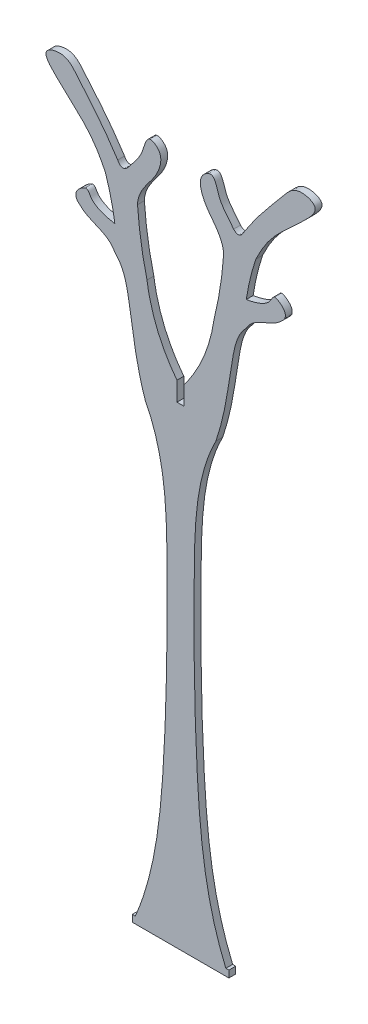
ISO-10303-21;
HEADER;
FILE_DESCRIPTION(('STEP AP214'),'2;1');
FILE_NAME('part.step','',(''),(''),'','','');
FILE_SCHEMA(('AUTOMOTIVE_DESIGN { 1 0 10303 214 1 1 1 1 }'));
ENDSEC;
DATA;
#1=APPLICATION_CONTEXT('core data for automotive mechanical design processes');
#2=APPLICATION_PROTOCOL_DEFINITION('international standard','automotive_design',2000,#1);
#3=PRODUCT_CONTEXT('',#1,'mechanical');
#4=PRODUCT('Part','Part','',(#3));
#5=PRODUCT_RELATED_PRODUCT_CATEGORY('part','',(#4));
#6=PRODUCT_DEFINITION_FORMATION('','',#4);
#7=PRODUCT_DEFINITION_CONTEXT('part definition',#1,'design');
#8=PRODUCT_DEFINITION('design','',#6,#7);
#9=PRODUCT_DEFINITION_SHAPE('','',#8);
#10=(LENGTH_UNIT() NAMED_UNIT(*) SI_UNIT(.MILLI.,.METRE.));
#11=(NAMED_UNIT(*) PLANE_ANGLE_UNIT() SI_UNIT($,.RADIAN.));
#12=(NAMED_UNIT(*) SI_UNIT($,.STERADIAN.) SOLID_ANGLE_UNIT());
#13=UNCERTAINTY_MEASURE_WITH_UNIT(LENGTH_MEASURE(1.E-05),#10,'distance_accuracy_value','');
#14=(GEOMETRIC_REPRESENTATION_CONTEXT(3) GLOBAL_UNCERTAINTY_ASSIGNED_CONTEXT((#13)) GLOBAL_UNIT_ASSIGNED_CONTEXT((#10,
#11,#12)) REPRESENTATION_CONTEXT('',''));
#15=CARTESIAN_POINT('',(0.,0.,0.));
#16=DIRECTION('',(0.,0.,1.));
#17=DIRECTION('',(1.,0.,0.));
#18=AXIS2_PLACEMENT_3D('',#15,#16,#17);
#19=CARTESIAN_POINT('',(-1511.29428119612,-519.438172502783,18.));
#20=DIRECTION('',(-2.81755677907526E-12,-1.,0.));
#21=DIRECTION('',(1.,-2.81755677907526E-12,0.));
#22=AXIS2_PLACEMENT_3D('',#19,#20,#21);
#23=PLANE('',#22);
#24=DIRECTION('',(-1.,2.81755677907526E-12,0.));
#25=VECTOR('',#24,1.);
#26=CARTESIAN_POINT('',(-1511.29428119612,-519.438172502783,0.));
#27=LINE('',#26,#25);
#28=CARTESIAN_POINT('',(-1503.29531998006,-519.438172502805,0.));
#29=VERTEX_POINT('',#28);
#30=CARTESIAN_POINT('',(-1511.29428119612,-519.438172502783,0.));
#31=VERTEX_POINT('',#30);
#32=EDGE_CURVE('E499',#29,#31,#27,.T.);
#33=ORIENTED_EDGE('',*,*,#32,.T.);
#34=DIRECTION('',(0.,0.,-1.));
#35=VECTOR('',#34,1.);
#36=CARTESIAN_POINT('',(-1511.29428119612,-519.438172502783,18.));
#37=LINE('',#36,#35);
#38=CARTESIAN_POINT('',(-1511.29428119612,-519.438172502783,18.));
#39=VERTEX_POINT('',#38);
#40=EDGE_CURVE('E11',#39,#31,#37,.T.);
#41=ORIENTED_EDGE('',*,*,#40,.F.);
#42=DIRECTION('',(-1.,2.81755677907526E-12,0.));
#43=VECTOR('',#42,1.);
#44=CARTESIAN_POINT('',(-1511.29428119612,-519.438172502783,18.));
#45=LINE('',#44,#43);
#46=CARTESIAN_POINT('',(-1503.29531998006,-519.438172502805,18.));
#47=VERTEX_POINT('',#46);
#48=EDGE_CURVE('E637',#47,#39,#45,.T.);
#49=ORIENTED_EDGE('',*,*,#48,.F.);
#50=DIRECTION('',(0.,0.,-1.));
#51=VECTOR('',#50,1.);
#52=CARTESIAN_POINT('',(-1503.29531998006,-519.438172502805,18.));
#53=LINE('',#52,#51);
#54=EDGE_CURVE('E244',#47,#29,#53,.T.);
#55=ORIENTED_EDGE('',*,*,#54,.T.);
#56=EDGE_LOOP('',(#33,#41,#49,#55));
#57=FACE_BOUND('',#56,.T.);
#58=ADVANCED_FACE('F32',(#57),#23,.F.);
#59=CARTESIAN_POINT('',(-1511.29428119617,-537.438172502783,18.));
#60=DIRECTION('',(1.,-2.81256499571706E-12,0.));
#61=DIRECTION('',(2.81256499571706E-12,1.,0.));
#62=AXIS2_PLACEMENT_3D('',#59,#60,#61);
#63=PLANE('',#62);
#64=DIRECTION('',(-2.81256499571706E-12,-1.,0.));
#65=VECTOR('',#64,1.);
#66=CARTESIAN_POINT('',(-1511.29428119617,-537.438172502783,0.));
#67=LINE('',#66,#65);
#68=CARTESIAN_POINT('',(-1511.29428119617,-537.438172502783,0.));
#69=VERTEX_POINT('',#68);
#70=EDGE_CURVE('E493',#31,#69,#67,.T.);
#71=ORIENTED_EDGE('',*,*,#70,.T.);
#72=DIRECTION('',(0.,0.,-1.));
#73=VECTOR('',#72,1.);
#74=CARTESIAN_POINT('',(-1511.29428119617,-537.438172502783,18.));
#75=LINE('',#74,#73);
#76=CARTESIAN_POINT('',(-1511.29428119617,-537.438172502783,18.));
#77=VERTEX_POINT('',#76);
#78=EDGE_CURVE('E40',#77,#69,#75,.T.);
#79=ORIENTED_EDGE('',*,*,#78,.F.);
#80=DIRECTION('',(-2.81256499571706E-12,-1.,0.));
#81=VECTOR('',#80,1.);
#82=CARTESIAN_POINT('',(-1511.29428119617,-537.438172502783,18.));
#83=LINE('',#82,#81);
#84=EDGE_CURVE('E151',#39,#77,#83,.T.);
#85=ORIENTED_EDGE('',*,*,#84,.F.);
#86=ORIENTED_EDGE('',*,*,#40,.T.);
#87=EDGE_LOOP('',(#71,#79,#85,#86));
#88=FACE_BOUND('',#87,.T.);
#89=ADVANCED_FACE('F683',(#88),#63,.F.);
#90=CARTESIAN_POINT('',(-1511.29428119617,-537.438172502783,18.));
#91=DIRECTION('',(2.81758703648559E-12,1.,0.));
#92=DIRECTION('',(-1.,2.81758703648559E-12,0.));
#93=AXIS2_PLACEMENT_3D('',#90,#91,#92);
#94=PLANE('',#93);
#95=DIRECTION('',(1.,-2.81758703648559E-12,0.));
#96=VECTOR('',#95,1.);
#97=CARTESIAN_POINT('',(-1511.29428119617,-537.438172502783,0.));
#98=LINE('',#97,#96);
#99=CARTESIAN_POINT('',(-1257.379244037,-537.438172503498,0.));
#100=VERTEX_POINT('',#99);
#101=EDGE_CURVE('E487',#69,#100,#98,.T.);
#102=ORIENTED_EDGE('',*,*,#101,.T.);
#103=DIRECTION('',(0.,0.,-1.));
#104=VECTOR('',#103,1.);
#105=CARTESIAN_POINT('',(-1257.379244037,-537.438172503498,18.));
#106=LINE('',#105,#104);
#107=CARTESIAN_POINT('',(-1257.379244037,-537.438172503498,18.));
#108=VERTEX_POINT('',#107);
#109=EDGE_CURVE('E479',#108,#100,#106,.T.);
#110=ORIENTED_EDGE('',*,*,#109,.F.);
#111=DIRECTION('',(1.,-2.81758703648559E-12,0.));
#112=VECTOR('',#111,1.);
#113=CARTESIAN_POINT('',(-1511.29428119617,-537.438172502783,18.));
#114=LINE('',#113,#112);
#115=EDGE_CURVE('E488',#77,#108,#114,.T.);
#116=ORIENTED_EDGE('',*,*,#115,.F.);
#117=ORIENTED_EDGE('',*,*,#78,.T.);
#118=EDGE_LOOP('',(#102,#110,#116,#117));
#119=FACE_BOUND('',#118,.T.);
#120=ADVANCED_FACE('F485',(#119),#94,.F.);
#121=CARTESIAN_POINT('',(-1257.37924403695,-519.438172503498,18.));
#122=DIRECTION('',(-1.,2.81256499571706E-12,0.));
#123=DIRECTION('',(-2.81256499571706E-12,-1.,0.));
#124=AXIS2_PLACEMENT_3D('',#121,#122,#123);
#125=PLANE('',#124);
#126=DIRECTION('',(2.81256499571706E-12,1.,0.));
#127=VECTOR('',#126,1.);
#128=CARTESIAN_POINT('',(-1257.37924403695,-519.438172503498,0.));
#129=LINE('',#128,#127);
#130=CARTESIAN_POINT('',(-1257.37924403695,-519.438172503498,0.));
#131=VERTEX_POINT('',#130);
#132=EDGE_CURVE('E495',#100,#131,#129,.T.);
#133=ORIENTED_EDGE('',*,*,#132,.T.);
#134=DIRECTION('',(0.,0.,-1.));
#135=VECTOR('',#134,1.);
#136=CARTESIAN_POINT('',(-1257.37924403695,-519.438172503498,18.));
#137=LINE('',#136,#135);
#138=CARTESIAN_POINT('',(-1257.37924403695,-519.438172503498,18.));
#139=VERTEX_POINT('',#138);
#140=EDGE_CURVE('E476',#139,#131,#137,.T.);
#141=ORIENTED_EDGE('',*,*,#140,.F.);
#142=DIRECTION('',(2.81256499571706E-12,1.,0.));
#143=VECTOR('',#142,1.);
#144=CARTESIAN_POINT('',(-1257.37924403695,-519.438172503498,18.));
#145=LINE('',#144,#143);
#146=EDGE_CURVE('E649',#108,#139,#145,.T.);
#147=ORIENTED_EDGE('',*,*,#146,.F.);
#148=ORIENTED_EDGE('',*,*,#109,.T.);
#149=EDGE_LOOP('',(#133,#141,#147,#148));
#150=FACE_BOUND('',#149,.T.);
#151=ADVANCED_FACE('F677',(#150),#125,.F.);
#152=CARTESIAN_POINT('',(-1265.37820525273,-519.438172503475,18.));
#153=DIRECTION('',(-2.81755677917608E-12,-1.,0.));
#154=DIRECTION('',(1.,-2.81755677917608E-12,0.));
#155=AXIS2_PLACEMENT_3D('',#152,#153,#154);
#156=PLANE('',#155);
#157=DIRECTION('',(-1.,2.81755677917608E-12,0.));
#158=VECTOR('',#157,1.);
#159=CARTESIAN_POINT('',(-1265.37820525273,-519.438172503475,0.));
#160=LINE('',#159,#158);
#161=CARTESIAN_POINT('',(-1265.37820525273,-519.438172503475,0.));
#162=VERTEX_POINT('',#161);
#163=EDGE_CURVE('E497',#131,#162,#160,.T.);
#164=ORIENTED_EDGE('',*,*,#163,.T.);
#165=DIRECTION('',(0.,0.,-1.));
#166=VECTOR('',#165,1.);
#167=CARTESIAN_POINT('',(-1265.37820525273,-519.438172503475,18.));
#168=LINE('',#167,#166);
#169=CARTESIAN_POINT('',(-1265.37820525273,-519.438172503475,18.));
#170=VERTEX_POINT('',#169);
#171=EDGE_CURVE('E473',#170,#162,#168,.T.);
#172=ORIENTED_EDGE('',*,*,#171,.F.);
#173=DIRECTION('',(-1.,2.81755677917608E-12,0.));
#174=VECTOR('',#173,1.);
#175=CARTESIAN_POINT('',(-1265.37820525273,-519.438172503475,18.));
#176=LINE('',#175,#174);
#177=EDGE_CURVE('E651',#139,#170,#176,.T.);
#178=ORIENTED_EDGE('',*,*,#177,.F.);
#179=ORIENTED_EDGE('',*,*,#140,.T.);
#180=EDGE_LOOP('',(#164,#172,#178,#179));
#181=FACE_BOUND('',#180,.T.);
#182=ADVANCED_FACE('F672',(#181),#156,.F.);
#183=CARTESIAN_POINT('',(-1265.37820525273,-519.438172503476,18.));
#184=CARTESIAN_POINT('',(-1287.45726612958,-467.720308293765,18.));
#185=CARTESIAN_POINT('',(-1323.80913077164,-340.019747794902,18.));
#186=CARTESIAN_POINT('',(-1347.89175846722,-55.1585898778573,18.));
#187=CARTESIAN_POINT('',(-1350.53965560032,285.79330852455,18.));
#188=CARTESIAN_POINT('',(-1345.81455719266,563.035618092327,18.));
#189=CARTESIAN_POINT('',(-1291.46742442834,667.917231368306,18.));
#190=B_SPLINE_CURVE_WITH_KNOTS('',3,(#183,#184,#185,#186,#187,#188,#189),.UNSPECIFIED.,.F.,.F.,
(4,1,1,1,4),(0.,0.136622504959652,0.325866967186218,0.696865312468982,0.984083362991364),.UNSPECIFIED.);
#191=DIRECTION('',(0.,0.,-1.));
#192=VECTOR('',#191,1.);
#193=SURFACE_OF_LINEAR_EXTRUSION('',#190,#192);
#194=CARTESIAN_POINT('',(-1265.37820525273,-519.438172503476,0.));
#195=CARTESIAN_POINT('',(-1287.45726612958,-467.720308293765,0.));
#196=CARTESIAN_POINT('',(-1323.80913077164,-340.019747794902,0.));
#197=CARTESIAN_POINT('',(-1347.89175846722,-55.1585898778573,0.));
#198=CARTESIAN_POINT('',(-1350.53965560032,285.79330852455,0.));
#199=CARTESIAN_POINT('',(-1345.81455719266,563.035618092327,0.));
#200=CARTESIAN_POINT('',(-1291.46742442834,667.917231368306,0.));
#201=B_SPLINE_CURVE_WITH_KNOTS('',3,(#194,#195,#196,#197,#198,#199,#200),.UNSPECIFIED.,.F.,.F.,
(4,1,1,1,4),(0.,0.136622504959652,0.325866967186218,0.696865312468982,0.984083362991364),.UNSPECIFIED.);
#202=CARTESIAN_POINT('',(-1291.46742442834,667.917231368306,0.));
#203=VERTEX_POINT('',#202);
#204=EDGE_CURVE('E503',#162,#203,#201,.T.);
#205=ORIENTED_EDGE('',*,*,#204,.T.);
#206=DIRECTION('',(0.,0.,-1.));
#207=VECTOR('',#206,1.);
#208=CARTESIAN_POINT('',(-1291.46742442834,667.917231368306,18.));
#209=LINE('',#208,#207);
#210=CARTESIAN_POINT('',(-1291.46742442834,667.917231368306,18.));
#211=VERTEX_POINT('',#210);
#212=EDGE_CURVE('E470',#211,#203,#209,.T.);
#213=ORIENTED_EDGE('',*,*,#212,.F.);
#214=EDGE_CURVE('E653',#170,#211,#190,.T.);
#215=ORIENTED_EDGE('',*,*,#214,.F.);
#216=ORIENTED_EDGE('',*,*,#171,.T.);
#217=EDGE_LOOP('',(#205,#213,#215,#216));
#218=FACE_BOUND('',#217,.T.);
#219=ADVANCED_FACE('F667',(#218),#193,.F.);
#220=CARTESIAN_POINT('',(-1291.46742442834,667.917231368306,18.));
#221=CARTESIAN_POINT('',(-1278.80325885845,705.017011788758,18.));
#222=CARTESIAN_POINT('',(-1262.09894114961,776.933907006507,18.));
#223=CARTESIAN_POINT('',(-1249.15473840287,879.299557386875,18.));
#224=CARTESIAN_POINT('',(-1234.26613656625,941.993846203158,18.));
#225=CARTESIAN_POINT('',(-1211.62006952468,964.822679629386,18.));
#226=B_SPLINE_CURVE_WITH_KNOTS('',3,(#220,#221,#222,#223,#224,#225),.UNSPECIFIED.,.F.,.F.,(4,1,
1,4),(0.,0.379260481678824,0.713287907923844,1.),.UNSPECIFIED.);
#227=DIRECTION('',(0.,0.,-1.));
#228=VECTOR('',#227,1.);
#229=SURFACE_OF_LINEAR_EXTRUSION('',#226,#228);
#230=CARTESIAN_POINT('',(-1291.46742442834,667.917231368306,0.));
#231=CARTESIAN_POINT('',(-1278.80325885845,705.017011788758,0.));
#232=CARTESIAN_POINT('',(-1262.09894114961,776.933907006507,0.));
#233=CARTESIAN_POINT('',(-1249.15473840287,879.299557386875,0.));
#234=CARTESIAN_POINT('',(-1234.26613656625,941.993846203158,0.));
#235=CARTESIAN_POINT('',(-1211.62006952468,964.822679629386,0.));
#236=B_SPLINE_CURVE_WITH_KNOTS('',3,(#230,#231,#232,#233,#234,#235),.UNSPECIFIED.,.F.,.F.,(4,1,
1,4),(0.,0.379260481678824,0.713287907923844,1.),.UNSPECIFIED.);
#237=CARTESIAN_POINT('',(-1211.62006952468,964.822679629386,0.));
#238=VERTEX_POINT('',#237);
#239=EDGE_CURVE('E507',#203,#238,#236,.T.);
#240=ORIENTED_EDGE('',*,*,#239,.T.);
#241=DIRECTION('',(0.,0.,-1.));
#242=VECTOR('',#241,1.);
#243=CARTESIAN_POINT('',(-1211.62006952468,964.822679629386,18.));
#244=LINE('',#243,#242);
#245=CARTESIAN_POINT('',(-1211.62006952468,964.822679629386,18.));
#246=VERTEX_POINT('',#245);
#247=EDGE_CURVE('E467',#246,#238,#244,.T.);
#248=ORIENTED_EDGE('',*,*,#247,.F.);
#249=EDGE_CURVE('E658',#211,#246,#226,.T.);
#250=ORIENTED_EDGE('',*,*,#249,.F.);
#251=ORIENTED_EDGE('',*,*,#212,.T.);
#252=EDGE_LOOP('',(#240,#248,#250,#251));
#253=FACE_BOUND('',#252,.T.);
#254=ADVANCED_FACE('F671',(#253),#229,.F.);
#255=CARTESIAN_POINT('',(-1211.62006952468,964.822679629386,18.));
#256=CARTESIAN_POINT('',(-1192.36168237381,1001.62275757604,18.));
#257=CARTESIAN_POINT('',(-1145.79768086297,999.806058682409,18.));
#258=CARTESIAN_POINT('',(-1118.99050541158,1027.71811654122,18.));
#259=B_SPLINE_CURVE_WITH_KNOTS('',3,(#255,#256,#257,#258),.UNSPECIFIED.,.F.,.F.,(4,4),(0.,1.),.UNSPECIFIED.);
#260=DIRECTION('',(0.,0.,-1.));
#261=VECTOR('',#260,1.);
#262=SURFACE_OF_LINEAR_EXTRUSION('',#259,#261);
#263=CARTESIAN_POINT('',(-1211.62006952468,964.822679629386,0.));
#264=CARTESIAN_POINT('',(-1192.36168237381,1001.62275757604,0.));
#265=CARTESIAN_POINT('',(-1145.79768086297,999.806058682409,0.));
#266=CARTESIAN_POINT('',(-1118.99050541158,1027.71811654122,0.));
#267=B_SPLINE_CURVE_WITH_KNOTS('',3,(#263,#264,#265,#266),.UNSPECIFIED.,.F.,.F.,(4,4),(0.,1.),.UNSPECIFIED.);
#268=CARTESIAN_POINT('',(-1118.99050541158,1027.71811654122,0.));
#269=VERTEX_POINT('',#268);
#270=EDGE_CURVE('E514',#238,#269,#267,.T.);
#271=ORIENTED_EDGE('',*,*,#270,.T.);
#272=DIRECTION('',(0.,0.,-1.));
#273=VECTOR('',#272,1.);
#274=CARTESIAN_POINT('',(-1118.99050541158,1027.71811654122,18.));
#275=LINE('',#274,#273);
#276=CARTESIAN_POINT('',(-1118.99050541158,1027.71811654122,18.));
#277=VERTEX_POINT('',#276);
#278=EDGE_CURVE('E464',#277,#269,#275,.T.);
#279=ORIENTED_EDGE('',*,*,#278,.F.);
#280=EDGE_CURVE('E944',#246,#277,#259,.T.);
#281=ORIENTED_EDGE('',*,*,#280,.F.);
#282=ORIENTED_EDGE('',*,*,#247,.T.);
#283=EDGE_LOOP('',(#271,#279,#281,#282));
#284=FACE_BOUND('',#283,.T.);
#285=ADVANCED_FACE('F727',(#284),#262,.F.);
#286=CARTESIAN_POINT('',(-1118.99050541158,1027.71811654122,18.));
#287=CARTESIAN_POINT('',(-1099.96715776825,1041.83106666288,18.));
#288=CARTESIAN_POINT('',(-1112.81295666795,1063.21847998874,18.));
#289=CARTESIAN_POINT('',(-1140.15232798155,1076.14677775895,18.));
#290=CARTESIAN_POINT('',(-1147.61665996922,1057.69885967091,18.));
#291=CARTESIAN_POINT('',(-1169.16528346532,1039.08750545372,18.));
#292=CARTESIAN_POINT('',(-1194.51965241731,1033.08454684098,18.));
#293=CARTESIAN_POINT('',(-1211.62006952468,1030.15246045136,18.));
#294=B_SPLINE_CURVE_WITH_KNOTS('',3,(#286,#287,#288,#289,#290,#291,#292,#293),.UNSPECIFIED.,.F.,
.F.,(4,1,1,1,1,4),(0.,0.336795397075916,0.409108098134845,0.521188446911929,0.643455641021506,
1.),.UNSPECIFIED.);
#295=DIRECTION('',(0.,0.,-1.));
#296=VECTOR('',#295,1.);
#297=SURFACE_OF_LINEAR_EXTRUSION('',#294,#296);
#298=CARTESIAN_POINT('',(-1118.99050541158,1027.71811654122,0.));
#299=CARTESIAN_POINT('',(-1099.96715776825,1041.83106666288,0.));
#300=CARTESIAN_POINT('',(-1112.81295666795,1063.21847998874,0.));
#301=CARTESIAN_POINT('',(-1140.15232798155,1076.14677775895,0.));
#302=CARTESIAN_POINT('',(-1147.61665996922,1057.69885967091,0.));
#303=CARTESIAN_POINT('',(-1169.16528346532,1039.08750545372,0.));
#304=CARTESIAN_POINT('',(-1194.51965241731,1033.08454684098,0.));
#305=CARTESIAN_POINT('',(-1211.62006952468,1030.15246045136,0.));
#306=B_SPLINE_CURVE_WITH_KNOTS('',3,(#298,#299,#300,#301,#302,#303,#304,#305),.UNSPECIFIED.,.F.,
.F.,(4,1,1,1,1,4),(0.,0.336795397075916,0.409108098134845,0.521188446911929,0.643455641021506,
1.),.UNSPECIFIED.);
#307=CARTESIAN_POINT('',(-1211.62006952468,1030.15246045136,0.));
#308=VERTEX_POINT('',#307);
#309=EDGE_CURVE('E521',#269,#308,#306,.T.);
#310=ORIENTED_EDGE('',*,*,#309,.T.);
#311=DIRECTION('',(0.,0.,-1.));
#312=VECTOR('',#311,1.);
#313=CARTESIAN_POINT('',(-1211.62006952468,1030.15246045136,18.));
#314=LINE('',#313,#312);
#315=CARTESIAN_POINT('',(-1211.62006952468,1030.15246045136,18.));
#316=VERTEX_POINT('',#315);
#317=EDGE_CURVE('E461',#316,#308,#314,.T.);
#318=ORIENTED_EDGE('',*,*,#317,.F.);
#319=EDGE_CURVE('E937',#277,#316,#294,.T.);
#320=ORIENTED_EDGE('',*,*,#319,.F.);
#321=ORIENTED_EDGE('',*,*,#278,.T.);
#322=EDGE_LOOP('',(#310,#318,#320,#321));
#323=FACE_BOUND('',#322,.T.);
#324=ADVANCED_FACE('F736',(#323),#297,.F.);
#325=CARTESIAN_POINT('',(-1211.62006952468,1030.15246045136,18.));
#326=CARTESIAN_POINT('',(-1203.78454107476,1083.42010421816,18.));
#327=CARTESIAN_POINT('',(-1186.60667726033,1134.53220551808,18.));
#328=B_SPLINE_CURVE_WITH_KNOTS('',2,(#325,#326,#327),.UNSPECIFIED.,.F.,.F.,(3,3),(0.,1.),.UNSPECIFIED.);
#329=DIRECTION('',(0.,0.,-1.));
#330=VECTOR('',#329,1.);
#331=SURFACE_OF_LINEAR_EXTRUSION('',#328,#330);
#332=CARTESIAN_POINT('',(-1211.62006952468,1030.15246045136,0.));
#333=CARTESIAN_POINT('',(-1203.78454107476,1083.42010421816,0.));
#334=CARTESIAN_POINT('',(-1186.60667726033,1134.53220551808,0.));
#335=B_SPLINE_CURVE_WITH_KNOTS('',2,(#332,#333,#334),.UNSPECIFIED.,.F.,.F.,(3,3),(0.,1.),.UNSPECIFIED.);
#336=CARTESIAN_POINT('',(-1186.60667726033,1134.53220551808,0.));
#337=VERTEX_POINT('',#336);
#338=EDGE_CURVE('E528',#308,#337,#335,.T.);
#339=ORIENTED_EDGE('',*,*,#338,.T.);
#340=DIRECTION('',(0.,0.,-1.));
#341=VECTOR('',#340,1.);
#342=CARTESIAN_POINT('',(-1186.60667726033,1134.53220551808,18.));
#343=LINE('',#342,#341);
#344=CARTESIAN_POINT('',(-1186.60667726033,1134.53220551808,18.));
#345=VERTEX_POINT('',#344);
#346=EDGE_CURVE('E458',#345,#337,#343,.T.);
#347=ORIENTED_EDGE('',*,*,#346,.F.);
#348=EDGE_CURVE('E929',#316,#345,#328,.T.);
#349=ORIENTED_EDGE('',*,*,#348,.F.);
#350=ORIENTED_EDGE('',*,*,#317,.T.);
#351=EDGE_LOOP('',(#339,#347,#349,#350));
#352=FACE_BOUND('',#351,.T.);
#353=ADVANCED_FACE('F745',(#352),#331,.F.);
#354=CARTESIAN_POINT('',(-1186.60667726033,1134.53220551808,18.));
#355=CARTESIAN_POINT('',(-1149.40099892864,1212.77116237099,18.));
#356=CARTESIAN_POINT('',(-1108.9398174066,1234.04744478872,18.));
#357=CARTESIAN_POINT('',(-1011.35737013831,1334.96569604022,18.));
#358=CARTESIAN_POINT('',(-1071.34135448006,1351.98572511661,18.));
#359=CARTESIAN_POINT('',(-1098.80744979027,1334.51720225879,18.));
#360=CARTESIAN_POINT('',(-1122.95795190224,1303.50484063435,18.));
#361=CARTESIAN_POINT('',(-1166.23987155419,1255.0222631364,18.));
#362=CARTESIAN_POINT('',(-1199.75169342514,1208.57672281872,18.));
#363=CARTESIAN_POINT('',(-1218.99104068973,1178.92762916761,18.));
#364=B_SPLINE_CURVE_WITH_KNOTS('',3,(#354,#355,#356,#357,#358,#359,#360,#361,#362,#363),
.UNSPECIFIED.,.F.,.F.,(4,1,1,1,1,1,1,4),(0.,0.385763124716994,0.485334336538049,
0.571206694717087,0.624037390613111,0.671733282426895,0.795732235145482,1.),.UNSPECIFIED.);
#365=DIRECTION('',(0.,0.,-1.));
#366=VECTOR('',#365,1.);
#367=SURFACE_OF_LINEAR_EXTRUSION('',#364,#366);
#368=CARTESIAN_POINT('',(-1186.60667726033,1134.53220551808,0.));
#369=CARTESIAN_POINT('',(-1149.40099892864,1212.77116237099,0.));
#370=CARTESIAN_POINT('',(-1108.9398174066,1234.04744478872,0.));
#371=CARTESIAN_POINT('',(-1011.35737013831,1334.96569604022,0.));
#372=CARTESIAN_POINT('',(-1071.34135448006,1351.98572511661,0.));
#373=CARTESIAN_POINT('',(-1098.80744979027,1334.51720225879,0.));
#374=CARTESIAN_POINT('',(-1122.95795190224,1303.50484063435,0.));
#375=CARTESIAN_POINT('',(-1166.23987155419,1255.0222631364,0.));
#376=CARTESIAN_POINT('',(-1199.75169342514,1208.57672281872,0.));
#377=CARTESIAN_POINT('',(-1218.99104068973,1178.92762916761,0.));
#378=B_SPLINE_CURVE_WITH_KNOTS('',3,(#368,#369,#370,#371,#372,#373,#374,#375,#376,#377),
.UNSPECIFIED.,.F.,.F.,(4,1,1,1,1,1,1,4),(0.,0.385763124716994,0.485334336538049,
0.571206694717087,0.624037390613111,0.671733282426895,0.795732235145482,1.),.UNSPECIFIED.);
#379=CARTESIAN_POINT('',(-1218.99104068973,1178.92762916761,0.));
#380=VERTEX_POINT('',#379);
#381=EDGE_CURVE('E535',#337,#380,#378,.T.);
#382=ORIENTED_EDGE('',*,*,#381,.T.);
#383=DIRECTION('',(0.,0.,-1.));
#384=VECTOR('',#383,1.);
#385=CARTESIAN_POINT('',(-1218.99104068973,1178.92762916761,18.));
#386=LINE('',#385,#384);
#387=CARTESIAN_POINT('',(-1218.99104068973,1178.92762916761,18.));
#388=VERTEX_POINT('',#387);
#389=EDGE_CURVE('E455',#388,#380,#386,.T.);
#390=ORIENTED_EDGE('',*,*,#389,.F.);
#391=EDGE_CURVE('E913',#345,#388,#364,.T.);
#392=ORIENTED_EDGE('',*,*,#391,.F.);
#393=ORIENTED_EDGE('',*,*,#346,.T.);
#394=EDGE_LOOP('',(#382,#390,#392,#393));
#395=FACE_BOUND('',#394,.T.);
#396=ADVANCED_FACE('F755',(#395),#367,.F.);
#397=CARTESIAN_POINT('',(-1218.99104068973,1178.92762916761,18.));
#398=CARTESIAN_POINT('',(-1229.80070851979,1158.86484057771,18.));
#399=CARTESIAN_POINT('',(-1244.79601062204,1173.85451622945,18.));
#400=B_SPLINE_CURVE_WITH_KNOTS('',2,(#397,#398,#399),.UNSPECIFIED.,.F.,.F.,(3,3),(0.,1.),.UNSPECIFIED.);
#401=DIRECTION('',(0.,0.,-1.));
#402=VECTOR('',#401,1.);
#403=SURFACE_OF_LINEAR_EXTRUSION('',#400,#402);
#404=CARTESIAN_POINT('',(-1218.99104068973,1178.92762916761,0.));
#405=CARTESIAN_POINT('',(-1229.80070851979,1158.86484057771,0.));
#406=CARTESIAN_POINT('',(-1244.79601062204,1173.85451622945,0.));
#407=B_SPLINE_CURVE_WITH_KNOTS('',2,(#404,#405,#406),.UNSPECIFIED.,.F.,.F.,(3,3),(0.,1.),.UNSPECIFIED.);
#408=CARTESIAN_POINT('',(-1244.79601062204,1173.85451622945,0.));
#409=VERTEX_POINT('',#408);
#410=EDGE_CURVE('E542',#380,#409,#407,.T.);
#411=ORIENTED_EDGE('',*,*,#410,.T.);
#412=DIRECTION('',(0.,0.,-1.));
#413=VECTOR('',#412,1.);
#414=CARTESIAN_POINT('',(-1244.79601062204,1173.85451622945,18.));
#415=LINE('',#414,#413);
#416=CARTESIAN_POINT('',(-1244.79601062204,1173.85451622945,18.));
#417=VERTEX_POINT('',#416);
#418=EDGE_CURVE('E452',#417,#409,#415,.T.);
#419=ORIENTED_EDGE('',*,*,#418,.F.);
#420=EDGE_CURVE('E912',#388,#417,#400,.T.);
#421=ORIENTED_EDGE('',*,*,#420,.F.);
#422=ORIENTED_EDGE('',*,*,#389,.T.);
#423=EDGE_LOOP('',(#411,#419,#421,#422));
#424=FACE_BOUND('',#423,.T.);
#425=ADVANCED_FACE('F765',(#424),#403,.F.);
#426=CARTESIAN_POINT('',(-1244.79601062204,1173.85451622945,18.));
#427=CARTESIAN_POINT('',(-1266.47505156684,1201.80617067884,18.));
#428=CARTESIAN_POINT('',(-1282.12972548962,1215.3674814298,18.));
#429=CARTESIAN_POINT('',(-1297.16624888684,1279.03474735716,18.));
#430=CARTESIAN_POINT('',(-1332.42652300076,1255.59841326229,18.));
#431=CARTESIAN_POINT('',(-1333.18015892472,1231.59021205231,18.));
#432=CARTESIAN_POINT('',(-1327.75313894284,1211.0213928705,18.));
#433=CARTESIAN_POINT('',(-1315.13896823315,1184.61300915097,18.));
#434=CARTESIAN_POINT('',(-1286.99086647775,1153.21107970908,18.));
#435=CARTESIAN_POINT('',(-1271.57130340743,1121.36323703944,18.));
#436=CARTESIAN_POINT('',(-1271.13665378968,1103.18448602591,18.));
#437=B_SPLINE_CURVE_WITH_KNOTS('',3,(#426,#427,#428,#429,#430,#431,#432,#433,#434,#435,#436),
.UNSPECIFIED.,.F.,.F.,(4,1,1,1,1,1,1,1,4),(0.,0.252302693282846,0.363690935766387,
0.456026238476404,0.541932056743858,0.588618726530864,0.664111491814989,0.825410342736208,1.),.UNSPECIFIED.);
#438=DIRECTION('',(0.,0.,-1.));
#439=VECTOR('',#438,1.);
#440=SURFACE_OF_LINEAR_EXTRUSION('',#437,#439);
#441=CARTESIAN_POINT('',(-1244.79601062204,1173.85451622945,0.));
#442=CARTESIAN_POINT('',(-1266.47505156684,1201.80617067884,0.));
#443=CARTESIAN_POINT('',(-1282.12972548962,1215.3674814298,0.));
#444=CARTESIAN_POINT('',(-1297.16624888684,1279.03474735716,0.));
#445=CARTESIAN_POINT('',(-1332.42652300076,1255.59841326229,0.));
#446=CARTESIAN_POINT('',(-1333.18015892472,1231.59021205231,0.));
#447=CARTESIAN_POINT('',(-1327.75313894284,1211.0213928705,0.));
#448=CARTESIAN_POINT('',(-1315.13896823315,1184.61300915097,0.));
#449=CARTESIAN_POINT('',(-1286.99086647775,1153.21107970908,0.));
#450=CARTESIAN_POINT('',(-1271.57130340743,1121.36323703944,0.));
#451=CARTESIAN_POINT('',(-1271.13665378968,1103.18448602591,0.));
#452=B_SPLINE_CURVE_WITH_KNOTS('',3,(#441,#442,#443,#444,#445,#446,#447,#448,#449,#450,#451),
.UNSPECIFIED.,.F.,.F.,(4,1,1,1,1,1,1,1,4),(0.,0.252302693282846,0.363690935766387,
0.456026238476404,0.541932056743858,0.588618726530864,0.664111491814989,0.825410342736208,1.),.UNSPECIFIED.);
#453=CARTESIAN_POINT('',(-1271.13665378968,1103.18448602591,0.));
#454=VERTEX_POINT('',#453);
#455=EDGE_CURVE('E549',#409,#454,#452,.T.);
#456=ORIENTED_EDGE('',*,*,#455,.T.);
#457=DIRECTION('',(0.,0.,-1.));
#458=VECTOR('',#457,1.);
#459=CARTESIAN_POINT('',(-1271.13665378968,1103.18448602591,18.));
#460=LINE('',#459,#458);
#461=CARTESIAN_POINT('',(-1271.13665378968,1103.18448602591,18.));
#462=VERTEX_POINT('',#461);
#463=EDGE_CURVE('E449',#462,#454,#460,.T.);
#464=ORIENTED_EDGE('',*,*,#463,.F.);
#465=EDGE_CURVE('E911',#417,#462,#437,.T.);
#466=ORIENTED_EDGE('',*,*,#465,.F.);
#467=ORIENTED_EDGE('',*,*,#418,.T.);
#468=EDGE_LOOP('',(#456,#464,#466,#467));
#469=FACE_BOUND('',#468,.T.);
#470=ADVANCED_FACE('F775',(#469),#440,.F.);
#471=CARTESIAN_POINT('',(-1271.13665378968,1103.18448602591,18.));
#472=CARTESIAN_POINT('',(-1276.6831977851,1022.67722106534,18.));
#473=CARTESIAN_POINT('',(-1296.05420812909,944.152143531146,18.));
#474=B_SPLINE_CURVE_WITH_KNOTS('',2,(#471,#472,#473),.UNSPECIFIED.,.F.,.F.,(3,3),(0.,1.),.UNSPECIFIED.);
#475=DIRECTION('',(0.,0.,-1.));
#476=VECTOR('',#475,1.);
#477=SURFACE_OF_LINEAR_EXTRUSION('',#474,#476);
#478=CARTESIAN_POINT('',(-1271.13665378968,1103.18448602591,0.));
#479=CARTESIAN_POINT('',(-1276.6831977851,1022.67722106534,0.));
#480=CARTESIAN_POINT('',(-1296.05420812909,944.152143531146,0.));
#481=B_SPLINE_CURVE_WITH_KNOTS('',2,(#478,#479,#480),.UNSPECIFIED.,.F.,.F.,(3,3),(0.,1.),.UNSPECIFIED.);
#482=CARTESIAN_POINT('',(-1296.05420812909,944.152143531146,0.));
#483=VERTEX_POINT('',#482);
#484=EDGE_CURVE('E556',#454,#483,#481,.T.);
#485=ORIENTED_EDGE('',*,*,#484,.T.);
#486=DIRECTION('',(0.,0.,-1.));
#487=VECTOR('',#486,1.);
#488=CARTESIAN_POINT('',(-1296.05420812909,944.152143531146,18.));
#489=LINE('',#488,#487);
#490=CARTESIAN_POINT('',(-1296.05420812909,944.152143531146,18.));
#491=VERTEX_POINT('',#490);
#492=EDGE_CURVE('E446',#491,#483,#489,.T.);
#493=ORIENTED_EDGE('',*,*,#492,.F.);
#494=EDGE_CURVE('E372',#462,#491,#474,.T.);
#495=ORIENTED_EDGE('',*,*,#494,.F.);
#496=ORIENTED_EDGE('',*,*,#463,.T.);
#497=EDGE_LOOP('',(#485,#493,#495,#496));
#498=FACE_BOUND('',#497,.T.);
#499=ADVANCED_FACE('F362',(#498),#477,.F.);
#500=CARTESIAN_POINT('',(-1296.05420812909,944.152143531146,18.));
#501=CARTESIAN_POINT('',(-1311.59146717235,837.753798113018,18.));
#502=CARTESIAN_POINT('',(-1374.83676261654,755.407069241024,18.));
#503=B_SPLINE_CURVE_WITH_KNOTS('',2,(#500,#501,#502),.UNSPECIFIED.,.F.,.F.,(3,3),(0.,1.),.UNSPECIFIED.);
#504=DIRECTION('',(0.,0.,-1.));
#505=VECTOR('',#504,1.);
#506=SURFACE_OF_LINEAR_EXTRUSION('',#503,#505);
#507=CARTESIAN_POINT('',(-1296.05420812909,944.152143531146,0.));
#508=CARTESIAN_POINT('',(-1311.59146717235,837.753798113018,0.));
#509=CARTESIAN_POINT('',(-1374.83676261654,755.407069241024,0.));
#510=B_SPLINE_CURVE_WITH_KNOTS('',2,(#507,#508,#509),.UNSPECIFIED.,.F.,.F.,(3,3),(0.,1.),.UNSPECIFIED.);
#511=CARTESIAN_POINT('',(-1374.83676261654,755.407069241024,0.));
#512=VERTEX_POINT('',#511);
#513=EDGE_CURVE('E563',#483,#512,#510,.T.);
#514=ORIENTED_EDGE('',*,*,#513,.T.);
#515=DIRECTION('',(0.,0.,-1.));
#516=VECTOR('',#515,1.);
#517=CARTESIAN_POINT('',(-1374.83676261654,755.407069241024,18.));
#518=LINE('',#517,#516);
#519=CARTESIAN_POINT('',(-1374.83676261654,755.407069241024,18.));
#520=VERTEX_POINT('',#519);
#521=EDGE_CURVE('E443',#520,#512,#518,.T.);
#522=ORIENTED_EDGE('',*,*,#521,.F.);
#523=EDGE_CURVE('E366',#491,#520,#503,.T.);
#524=ORIENTED_EDGE('',*,*,#523,.F.);
#525=ORIENTED_EDGE('',*,*,#492,.T.);
#526=EDGE_LOOP('',(#514,#522,#524,#525));
#527=FACE_BOUND('',#526,.T.);
#528=ADVANCED_FACE('F357',(#527),#506,.F.);
#529=CARTESIAN_POINT('',(-1374.83676261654,755.407069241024,18.));
#530=DIRECTION('',(1.,0.,0.));
#531=DIRECTION('',(0.,0.,-1.));
#532=AXIS2_PLACEMENT_3D('',#529,#530,#531);
#533=PLANE('',#532);
#534=DIRECTION('',(0.,-1.,0.));
#535=VECTOR('',#534,1.);
#536=CARTESIAN_POINT('',(-1374.83676261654,755.407069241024,0.));
#537=LINE('',#536,#535);
#538=CARTESIAN_POINT('',(-1374.83676261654,705.407069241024,0.));
#539=VERTEX_POINT('',#538);
#540=EDGE_CURVE('E570',#512,#539,#537,.T.);
#541=ORIENTED_EDGE('',*,*,#540,.T.);
#542=DIRECTION('',(0.,0.,-1.));
#543=VECTOR('',#542,1.);
#544=CARTESIAN_POINT('',(-1374.83676261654,705.407069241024,18.));
#545=LINE('',#544,#543);
#546=CARTESIAN_POINT('',(-1374.83676261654,705.407069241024,18.));
#547=VERTEX_POINT('',#546);
#548=EDGE_CURVE('E440',#547,#539,#545,.T.);
#549=ORIENTED_EDGE('',*,*,#548,.F.);
#550=DIRECTION('',(0.,-1.,0.));
#551=VECTOR('',#550,1.);
#552=CARTESIAN_POINT('',(-1374.83676261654,755.407069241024,18.));
#553=LINE('',#552,#551);
#554=EDGE_CURVE('E371',#520,#547,#553,.T.);
#555=ORIENTED_EDGE('',*,*,#554,.F.);
#556=ORIENTED_EDGE('',*,*,#521,.T.);
#557=EDGE_LOOP('',(#541,#549,#555,#556));
#558=FACE_BOUND('',#557,.T.);
#559=ADVANCED_FACE('F353',(#558),#533,.F.);
#560=CARTESIAN_POINT('',(-1393.83676261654,705.407069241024,18.));
#561=DIRECTION('',(0.,-1.,0.));
#562=DIRECTION('',(0.,0.,-1.));
#563=AXIS2_PLACEMENT_3D('',#560,#561,#562);
#564=PLANE('',#563);
#565=DIRECTION('',(-1.,0.,0.));
#566=VECTOR('',#565,1.);
#567=CARTESIAN_POINT('',(-1393.83676261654,705.407069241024,0.));
#568=LINE('',#567,#566);
#569=CARTESIAN_POINT('',(-1393.83676261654,705.407069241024,0.));
#570=VERTEX_POINT('',#569);
#571=EDGE_CURVE('E575',#539,#570,#568,.T.);
#572=ORIENTED_EDGE('',*,*,#571,.T.);
#573=DIRECTION('',(0.,0.,-1.));
#574=VECTOR('',#573,1.);
#575=CARTESIAN_POINT('',(-1393.83676261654,705.407069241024,18.));
#576=LINE('',#575,#574);
#577=CARTESIAN_POINT('',(-1393.83676261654,705.407069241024,18.));
#578=VERTEX_POINT('',#577);
#579=EDGE_CURVE('E393',#578,#570,#576,.T.);
#580=ORIENTED_EDGE('',*,*,#579,.F.);
#581=DIRECTION('',(-1.,0.,0.));
#582=VECTOR('',#581,1.);
#583=CARTESIAN_POINT('',(-1393.83676261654,705.407069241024,18.));
#584=LINE('',#583,#582);
#585=EDGE_CURVE('E380',#547,#578,#584,.T.);
#586=ORIENTED_EDGE('',*,*,#585,.F.);
#587=ORIENTED_EDGE('',*,*,#548,.T.);
#588=EDGE_LOOP('',(#572,#580,#586,#587));
#589=FACE_BOUND('',#588,.T.);
#590=ADVANCED_FACE('F349',(#589),#564,.F.);
#591=CARTESIAN_POINT('',(-1393.83676261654,755.407069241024,18.));
#592=DIRECTION('',(-1.,0.,0.));
#593=DIRECTION('',(0.,0.,1.));
#594=AXIS2_PLACEMENT_3D('',#591,#592,#593);
#595=PLANE('',#594);
#596=DIRECTION('',(0.,1.,0.));
#597=VECTOR('',#596,1.);
#598=CARTESIAN_POINT('',(-1393.83676261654,755.407069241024,0.));
#599=LINE('',#598,#597);
#600=CARTESIAN_POINT('',(-1393.83676261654,755.407069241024,0.));
#601=VERTEX_POINT('',#600);
#602=EDGE_CURVE('E391',#570,#601,#599,.T.);
#603=ORIENTED_EDGE('',*,*,#602,.T.);
#604=DIRECTION('',(0.,0.,-1.));
#605=VECTOR('',#604,1.);
#606=CARTESIAN_POINT('',(-1393.83676261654,755.407069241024,18.));
#607=LINE('',#606,#605);
#608=CARTESIAN_POINT('',(-1393.83676261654,755.407069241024,18.));
#609=VERTEX_POINT('',#608);
#610=EDGE_CURVE('E389',#609,#601,#607,.T.);
#611=ORIENTED_EDGE('',*,*,#610,.F.);
#612=DIRECTION('',(0.,1.,0.));
#613=VECTOR('',#612,1.);
#614=CARTESIAN_POINT('',(-1393.83676261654,755.407069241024,18.));
#615=LINE('',#614,#613);
#616=EDGE_CURVE('E337',#578,#609,#615,.T.);
#617=ORIENTED_EDGE('',*,*,#616,.F.);
#618=ORIENTED_EDGE('',*,*,#579,.T.);
#619=EDGE_LOOP('',(#603,#611,#617,#618));
#620=FACE_BOUND('',#619,.T.);
#621=ADVANCED_FACE('F345',(#620),#595,.F.);
#622=CARTESIAN_POINT('',(-1393.83676261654,755.407069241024,18.));
#623=CARTESIAN_POINT('',(-1457.08205806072,837.753798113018,18.));
#624=CARTESIAN_POINT('',(-1472.61931710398,944.152143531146,18.));
#625=B_SPLINE_CURVE_WITH_KNOTS('',2,(#622,#623,#624),.UNSPECIFIED.,.F.,.F.,(3,3),(0.,1.),.UNSPECIFIED.);
#626=DIRECTION('',(0.,0.,-1.));
#627=VECTOR('',#626,1.);
#628=SURFACE_OF_LINEAR_EXTRUSION('',#625,#627);
#629=CARTESIAN_POINT('',(-1393.83676261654,755.407069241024,0.));
#630=CARTESIAN_POINT('',(-1457.08205806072,837.753798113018,0.));
#631=CARTESIAN_POINT('',(-1472.61931710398,944.152143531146,0.));
#632=B_SPLINE_CURVE_WITH_KNOTS('',2,(#629,#630,#631),.UNSPECIFIED.,.F.,.F.,(3,3),(0.,1.),.UNSPECIFIED.);
#633=CARTESIAN_POINT('',(-1472.61931710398,944.152143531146,0.));
#634=VERTEX_POINT('',#633);
#635=EDGE_CURVE('E398',#601,#634,#632,.T.);
#636=ORIENTED_EDGE('',*,*,#635,.T.);
#637=DIRECTION('',(0.,0.,-1.));
#638=VECTOR('',#637,1.);
#639=CARTESIAN_POINT('',(-1472.61931710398,944.152143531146,18.));
#640=LINE('',#639,#638);
#641=CARTESIAN_POINT('',(-1472.61931710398,944.152143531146,18.));
#642=VERTEX_POINT('',#641);
#643=EDGE_CURVE('E394',#642,#634,#640,.T.);
#644=ORIENTED_EDGE('',*,*,#643,.F.);
#645=EDGE_CURVE('E329',#609,#642,#625,.T.);
#646=ORIENTED_EDGE('',*,*,#645,.F.);
#647=ORIENTED_EDGE('',*,*,#610,.T.);
#648=EDGE_LOOP('',(#636,#644,#646,#647));
#649=FACE_BOUND('',#648,.T.);
#650=ADVANCED_FACE('F342',(#649),#628,.F.);
#651=CARTESIAN_POINT('',(-1472.61931710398,944.152143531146,18.));
#652=CARTESIAN_POINT('',(-1491.99032744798,1022.67722106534,18.));
#653=CARTESIAN_POINT('',(-1497.53687144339,1103.18448602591,18.));
#654=B_SPLINE_CURVE_WITH_KNOTS('',2,(#651,#652,#653),.UNSPECIFIED.,.F.,.F.,(3,3),(0.,1.),.UNSPECIFIED.);
#655=DIRECTION('',(0.,0.,-1.));
#656=VECTOR('',#655,1.);
#657=SURFACE_OF_LINEAR_EXTRUSION('',#654,#656);
#658=CARTESIAN_POINT('',(-1472.61931710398,944.152143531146,0.));
#659=CARTESIAN_POINT('',(-1491.99032744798,1022.67722106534,0.));
#660=CARTESIAN_POINT('',(-1497.53687144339,1103.18448602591,0.));
#661=B_SPLINE_CURVE_WITH_KNOTS('',2,(#658,#659,#660),.UNSPECIFIED.,.F.,.F.,(3,3),(0.,1.),.UNSPECIFIED.);
#662=CARTESIAN_POINT('',(-1497.53687144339,1103.18448602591,0.));
#663=VERTEX_POINT('',#662);
#664=EDGE_CURVE('E581',#634,#663,#661,.T.);
#665=ORIENTED_EDGE('',*,*,#664,.T.);
#666=DIRECTION('',(0.,0.,-1.));
#667=VECTOR('',#666,1.);
#668=CARTESIAN_POINT('',(-1497.53687144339,1103.18448602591,18.));
#669=LINE('',#668,#667);
#670=CARTESIAN_POINT('',(-1497.53687144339,1103.18448602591,18.));
#671=VERTEX_POINT('',#670);
#672=EDGE_CURVE('E401',#671,#663,#669,.T.);
#673=ORIENTED_EDGE('',*,*,#672,.F.);
#674=EDGE_CURVE('E321',#642,#671,#654,.T.);
#675=ORIENTED_EDGE('',*,*,#674,.F.);
#676=ORIENTED_EDGE('',*,*,#643,.T.);
#677=EDGE_LOOP('',(#665,#673,#675,#676));
#678=FACE_BOUND('',#677,.T.);
#679=ADVANCED_FACE('F313',(#678),#657,.F.);
#680=CARTESIAN_POINT('',(-1497.53687144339,1103.18448602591,18.));
#681=CARTESIAN_POINT('',(-1497.10222182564,1121.36323703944,18.));
#682=CARTESIAN_POINT('',(-1481.68265875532,1153.21107970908,18.));
#683=CARTESIAN_POINT('',(-1453.53455699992,1184.61300915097,18.));
#684=CARTESIAN_POINT('',(-1440.92038629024,1211.0213928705,18.));
#685=CARTESIAN_POINT('',(-1435.49336630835,1231.59021205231,18.));
#686=CARTESIAN_POINT('',(-1436.24700223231,1255.59841326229,18.));
#687=CARTESIAN_POINT('',(-1471.50727634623,1279.03474735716,18.));
#688=CARTESIAN_POINT('',(-1486.54379974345,1215.3674814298,18.));
#689=CARTESIAN_POINT('',(-1502.19847366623,1201.80617067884,18.));
#690=CARTESIAN_POINT('',(-1523.87751461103,1173.85451622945,18.));
#691=B_SPLINE_CURVE_WITH_KNOTS('',3,(#680,#681,#682,#683,#684,#685,#686,#687,#688,#689,#690),
.UNSPECIFIED.,.F.,.F.,(4,1,1,1,1,1,1,1,4),(0.,0.174589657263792,0.335888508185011,
0.411381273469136,0.458067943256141,0.543973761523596,0.636309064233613,0.747697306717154,1.),.UNSPECIFIED.);
#692=DIRECTION('',(0.,0.,-1.));
#693=VECTOR('',#692,1.);
#694=SURFACE_OF_LINEAR_EXTRUSION('',#691,#693);
#695=CARTESIAN_POINT('',(-1497.53687144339,1103.18448602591,0.));
#696=CARTESIAN_POINT('',(-1497.10222182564,1121.36323703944,0.));
#697=CARTESIAN_POINT('',(-1481.68265875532,1153.21107970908,0.));
#698=CARTESIAN_POINT('',(-1453.53455699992,1184.61300915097,0.));
#699=CARTESIAN_POINT('',(-1440.92038629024,1211.0213928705,0.));
#700=CARTESIAN_POINT('',(-1435.49336630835,1231.59021205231,0.));
#701=CARTESIAN_POINT('',(-1436.24700223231,1255.59841326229,0.));
#702=CARTESIAN_POINT('',(-1471.50727634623,1279.03474735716,0.));
#703=CARTESIAN_POINT('',(-1486.54379974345,1215.3674814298,0.));
#704=CARTESIAN_POINT('',(-1502.19847366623,1201.80617067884,0.));
#705=CARTESIAN_POINT('',(-1523.87751461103,1173.85451622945,0.));
#706=B_SPLINE_CURVE_WITH_KNOTS('',3,(#695,#696,#697,#698,#699,#700,#701,#702,#703,#704,#705),
.UNSPECIFIED.,.F.,.F.,(4,1,1,1,1,1,1,1,4),(0.,0.174589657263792,0.335888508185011,
0.411381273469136,0.458067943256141,0.543973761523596,0.636309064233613,0.747697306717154,1.),.UNSPECIFIED.);
#707=CARTESIAN_POINT('',(-1523.87751461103,1173.85451622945,0.));
#708=VERTEX_POINT('',#707);
#709=EDGE_CURVE('E412',#663,#708,#706,.T.);
#710=ORIENTED_EDGE('',*,*,#709,.T.);
#711=DIRECTION('',(0.,0.,-1.));
#712=VECTOR('',#711,1.);
#713=CARTESIAN_POINT('',(-1523.87751461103,1173.85451622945,18.));
#714=LINE('',#713,#712);
#715=CARTESIAN_POINT('',(-1523.87751461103,1173.85451622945,18.));
#716=VERTEX_POINT('',#715);
#717=EDGE_CURVE('E410',#716,#708,#714,.T.);
#718=ORIENTED_EDGE('',*,*,#717,.F.);
#719=EDGE_CURVE('E317',#671,#716,#691,.T.);
#720=ORIENTED_EDGE('',*,*,#719,.F.);
#721=ORIENTED_EDGE('',*,*,#672,.T.);
#722=EDGE_LOOP('',(#710,#718,#720,#721));
#723=FACE_BOUND('',#722,.T.);
#724=ADVANCED_FACE('F309',(#723),#694,.F.);
#725=CARTESIAN_POINT('',(-1523.87751461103,1173.85451622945,18.));
#726=CARTESIAN_POINT('',(-1538.87281671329,1158.86484057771,18.));
#727=CARTESIAN_POINT('',(-1549.68248454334,1178.92762916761,18.));
#728=B_SPLINE_CURVE_WITH_KNOTS('',2,(#725,#726,#727),.UNSPECIFIED.,.F.,.F.,(3,3),(0.,1.),.UNSPECIFIED.);
#729=DIRECTION('',(0.,0.,-1.));
#730=VECTOR('',#729,1.);
#731=SURFACE_OF_LINEAR_EXTRUSION('',#728,#730);
#732=CARTESIAN_POINT('',(-1523.87751461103,1173.85451622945,0.));
#733=CARTESIAN_POINT('',(-1538.87281671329,1158.86484057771,0.));
#734=CARTESIAN_POINT('',(-1549.68248454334,1178.92762916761,0.));
#735=B_SPLINE_CURVE_WITH_KNOTS('',2,(#732,#733,#734),.UNSPECIFIED.,.F.,.F.,(3,3),(0.,1.),.UNSPECIFIED.);
#736=CARTESIAN_POINT('',(-1549.68248454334,1178.92762916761,0.));
#737=VERTEX_POINT('',#736);
#738=EDGE_CURVE('E418',#708,#737,#735,.T.);
#739=ORIENTED_EDGE('',*,*,#738,.T.);
#740=DIRECTION('',(0.,0.,-1.));
#741=VECTOR('',#740,1.);
#742=CARTESIAN_POINT('',(-1549.68248454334,1178.92762916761,18.));
#743=LINE('',#742,#741);
#744=CARTESIAN_POINT('',(-1549.68248454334,1178.92762916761,18.));
#745=VERTEX_POINT('',#744);
#746=EDGE_CURVE('E414',#745,#737,#743,.T.);
#747=ORIENTED_EDGE('',*,*,#746,.F.);
#748=EDGE_CURVE('E294',#716,#745,#728,.T.);
#749=ORIENTED_EDGE('',*,*,#748,.F.);
#750=ORIENTED_EDGE('',*,*,#717,.T.);
#751=EDGE_LOOP('',(#739,#747,#749,#750));
#752=FACE_BOUND('',#751,.T.);
#753=ADVANCED_FACE('F305',(#752),#731,.F.);
#754=CARTESIAN_POINT('',(-1549.68248454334,1178.92762916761,18.));
#755=CARTESIAN_POINT('',(-1568.92183180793,1208.57672281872,18.));
#756=CARTESIAN_POINT('',(-1602.43365367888,1255.0222631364,18.));
#757=CARTESIAN_POINT('',(-1645.71557333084,1303.50484063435,18.));
#758=CARTESIAN_POINT('',(-1669.8660754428,1334.51720225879,18.));
#759=CARTESIAN_POINT('',(-1697.33217075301,1351.98572511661,18.));
#760=CARTESIAN_POINT('',(-1757.31615509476,1334.96569604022,18.));
#761=CARTESIAN_POINT('',(-1659.73370782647,1234.04744478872,18.));
#762=CARTESIAN_POINT('',(-1619.27252630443,1212.77116237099,18.));
#763=CARTESIAN_POINT('',(-1582.06684797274,1134.53220551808,18.));
#764=B_SPLINE_CURVE_WITH_KNOTS('',3,(#754,#755,#756,#757,#758,#759,#760,#761,#762,#763),
.UNSPECIFIED.,.F.,.F.,(4,1,1,1,1,1,1,4),(0.,0.204267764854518,0.328266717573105,
0.375962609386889,0.428793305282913,0.514665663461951,0.614236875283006,1.),.UNSPECIFIED.);
#765=DIRECTION('',(0.,0.,-1.));
#766=VECTOR('',#765,1.);
#767=SURFACE_OF_LINEAR_EXTRUSION('',#764,#766);
#768=CARTESIAN_POINT('',(-1549.68248454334,1178.92762916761,0.));
#769=CARTESIAN_POINT('',(-1568.92183180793,1208.57672281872,0.));
#770=CARTESIAN_POINT('',(-1602.43365367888,1255.0222631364,0.));
#771=CARTESIAN_POINT('',(-1645.71557333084,1303.50484063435,0.));
#772=CARTESIAN_POINT('',(-1669.8660754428,1334.51720225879,0.));
#773=CARTESIAN_POINT('',(-1697.33217075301,1351.98572511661,0.));
#774=CARTESIAN_POINT('',(-1757.31615509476,1334.96569604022,0.));
#775=CARTESIAN_POINT('',(-1659.73370782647,1234.04744478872,0.));
#776=CARTESIAN_POINT('',(-1619.27252630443,1212.77116237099,0.));
#777=CARTESIAN_POINT('',(-1582.06684797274,1134.53220551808,0.));
#778=B_SPLINE_CURVE_WITH_KNOTS('',3,(#768,#769,#770,#771,#772,#773,#774,#775,#776,#777),
.UNSPECIFIED.,.F.,.F.,(4,1,1,1,1,1,1,4),(0.,0.204267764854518,0.328266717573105,
0.375962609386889,0.428793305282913,0.514665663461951,0.614236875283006,1.),.UNSPECIFIED.);
#779=CARTESIAN_POINT('',(-1582.06684797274,1134.53220551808,0.));
#780=VERTEX_POINT('',#779);
#781=EDGE_CURVE('E600',#737,#780,#778,.T.);
#782=ORIENTED_EDGE('',*,*,#781,.T.);
#783=DIRECTION('',(0.,0.,-1.));
#784=VECTOR('',#783,1.);
#785=CARTESIAN_POINT('',(-1582.06684797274,1134.53220551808,18.));
#786=LINE('',#785,#784);
#787=CARTESIAN_POINT('',(-1582.06684797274,1134.53220551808,18.));
#788=VERTEX_POINT('',#787);
#789=EDGE_CURVE('E420',#788,#780,#786,.T.);
#790=ORIENTED_EDGE('',*,*,#789,.F.);
#791=EDGE_CURVE('E286',#745,#788,#764,.T.);
#792=ORIENTED_EDGE('',*,*,#791,.F.);
#793=ORIENTED_EDGE('',*,*,#746,.T.);
#794=EDGE_LOOP('',(#782,#790,#792,#793));
#795=FACE_BOUND('',#794,.T.);
#796=ADVANCED_FACE('F302',(#795),#767,.F.);
#797=CARTESIAN_POINT('',(-1582.06684797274,1134.53220551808,18.));
#798=CARTESIAN_POINT('',(-1564.88898415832,1083.42010421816,18.));
#799=CARTESIAN_POINT('',(-1557.05345570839,1030.15246045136,18.));
#800=B_SPLINE_CURVE_WITH_KNOTS('',2,(#797,#798,#799),.UNSPECIFIED.,.F.,.F.,(3,3),(0.,1.),.UNSPECIFIED.);
#801=DIRECTION('',(0.,0.,-1.));
#802=VECTOR('',#801,1.);
#803=SURFACE_OF_LINEAR_EXTRUSION('',#800,#802);
#804=CARTESIAN_POINT('',(-1582.06684797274,1134.53220551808,0.));
#805=CARTESIAN_POINT('',(-1564.88898415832,1083.42010421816,0.));
#806=CARTESIAN_POINT('',(-1557.05345570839,1030.15246045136,0.));
#807=B_SPLINE_CURVE_WITH_KNOTS('',2,(#804,#805,#806),.UNSPECIFIED.,.F.,.F.,(3,3),(0.,1.),.UNSPECIFIED.);
#808=CARTESIAN_POINT('',(-1557.05345570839,1030.15246045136,0.));
#809=VERTEX_POINT('',#808);
#810=EDGE_CURVE('E430',#780,#809,#807,.T.);
#811=ORIENTED_EDGE('',*,*,#810,.T.);
#812=DIRECTION('',(0.,0.,-1.));
#813=VECTOR('',#812,1.);
#814=CARTESIAN_POINT('',(-1557.05345570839,1030.15246045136,18.));
#815=LINE('',#814,#813);
#816=CARTESIAN_POINT('',(-1557.05345570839,1030.15246045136,18.));
#817=VERTEX_POINT('',#816);
#818=EDGE_CURVE('E428',#817,#809,#815,.T.);
#819=ORIENTED_EDGE('',*,*,#818,.F.);
#820=EDGE_CURVE('E278',#788,#817,#800,.T.);
#821=ORIENTED_EDGE('',*,*,#820,.F.);
#822=ORIENTED_EDGE('',*,*,#789,.T.);
#823=EDGE_LOOP('',(#811,#819,#821,#822));
#824=FACE_BOUND('',#823,.T.);
#825=ADVANCED_FACE('F271',(#824),#803,.F.);
#826=CARTESIAN_POINT('',(-1557.05345570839,1030.15246045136,18.));
#827=CARTESIAN_POINT('',(-1574.15387281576,1033.08454684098,18.));
#828=CARTESIAN_POINT('',(-1599.50824176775,1039.08750545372,18.));
#829=CARTESIAN_POINT('',(-1621.05686526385,1057.69885967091,18.));
#830=CARTESIAN_POINT('',(-1628.52119725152,1076.14677775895,18.));
#831=CARTESIAN_POINT('',(-1655.86056856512,1063.21847998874,18.));
#832=CARTESIAN_POINT('',(-1668.70636746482,1041.83106666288,18.));
#833=CARTESIAN_POINT('',(-1649.68301982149,1027.71811654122,18.));
#834=B_SPLINE_CURVE_WITH_KNOTS('',3,(#826,#827,#828,#829,#830,#831,#832,#833),.UNSPECIFIED.,.F.,
.F.,(4,1,1,1,1,4),(0.,0.356544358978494,0.478811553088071,0.590891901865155,0.663204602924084,
1.),.UNSPECIFIED.);
#835=DIRECTION('',(0.,0.,-1.));
#836=VECTOR('',#835,1.);
#837=SURFACE_OF_LINEAR_EXTRUSION('',#834,#836);
#838=CARTESIAN_POINT('',(-1557.05345570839,1030.15246045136,0.));
#839=CARTESIAN_POINT('',(-1574.15387281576,1033.08454684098,0.));
#840=CARTESIAN_POINT('',(-1599.50824176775,1039.08750545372,0.));
#841=CARTESIAN_POINT('',(-1621.05686526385,1057.69885967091,0.));
#842=CARTESIAN_POINT('',(-1628.52119725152,1076.14677775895,0.));
#843=CARTESIAN_POINT('',(-1655.86056856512,1063.21847998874,0.));
#844=CARTESIAN_POINT('',(-1668.70636746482,1041.83106666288,0.));
#845=CARTESIAN_POINT('',(-1649.68301982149,1027.71811654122,0.));
#846=B_SPLINE_CURVE_WITH_KNOTS('',3,(#838,#839,#840,#841,#842,#843,#844,#845),.UNSPECIFIED.,.F.,
.F.,(4,1,1,1,1,4),(0.,0.356544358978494,0.478811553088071,0.590891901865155,0.663204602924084,
1.),.UNSPECIFIED.);
#847=CARTESIAN_POINT('',(-1649.68301982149,1027.71811654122,0.));
#848=VERTEX_POINT('',#847);
#849=EDGE_CURVE('E433',#809,#848,#846,.T.);
#850=ORIENTED_EDGE('',*,*,#849,.T.);
#851=DIRECTION('',(0.,0.,-1.));
#852=VECTOR('',#851,1.);
#853=CARTESIAN_POINT('',(-1649.68301982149,1027.71811654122,18.));
#854=LINE('',#853,#852);
#855=CARTESIAN_POINT('',(-1649.68301982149,1027.71811654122,18.));
#856=VERTEX_POINT('',#855);
#857=EDGE_CURVE('E239',#856,#848,#854,.T.);
#858=ORIENTED_EDGE('',*,*,#857,.F.);
#859=EDGE_CURVE('E230',#817,#856,#834,.T.);
#860=ORIENTED_EDGE('',*,*,#859,.F.);
#861=ORIENTED_EDGE('',*,*,#818,.T.);
#862=EDGE_LOOP('',(#850,#858,#860,#861));
#863=FACE_BOUND('',#862,.T.);
#864=ADVANCED_FACE('F268',(#863),#837,.F.);
#865=CARTESIAN_POINT('',(-1649.68301982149,1027.71811654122,18.));
#866=CARTESIAN_POINT('',(-1622.8758443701,999.806058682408,18.));
#867=CARTESIAN_POINT('',(-1576.31184285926,1001.62275757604,18.));
#868=CARTESIAN_POINT('',(-1557.05345570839,964.822679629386,18.));
#869=B_SPLINE_CURVE_WITH_KNOTS('',3,(#865,#866,#867,#868),.UNSPECIFIED.,.F.,.F.,(4,4),(0.,1.),.UNSPECIFIED.);
#870=DIRECTION('',(0.,0.,-1.));
#871=VECTOR('',#870,1.);
#872=SURFACE_OF_LINEAR_EXTRUSION('',#869,#871);
#873=CARTESIAN_POINT('',(-1649.68301982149,1027.71811654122,0.));
#874=CARTESIAN_POINT('',(-1622.8758443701,999.806058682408,0.));
#875=CARTESIAN_POINT('',(-1576.31184285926,1001.62275757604,0.));
#876=CARTESIAN_POINT('',(-1557.05345570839,964.822679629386,0.));
#877=B_SPLINE_CURVE_WITH_KNOTS('',3,(#873,#874,#875,#876),.UNSPECIFIED.,.F.,.F.,(4,4),(0.,1.),.UNSPECIFIED.);
#878=CARTESIAN_POINT('',(-1557.05345570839,964.822679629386,0.));
#879=VERTEX_POINT('',#878);
#880=EDGE_CURVE('E238',#848,#879,#877,.T.);
#881=ORIENTED_EDGE('',*,*,#880,.T.);
#882=DIRECTION('',(0.,0.,-1.));
#883=VECTOR('',#882,1.);
#884=CARTESIAN_POINT('',(-1557.05345570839,964.822679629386,18.));
#885=LINE('',#884,#883);
#886=CARTESIAN_POINT('',(-1557.05345570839,964.822679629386,18.));
#887=VERTEX_POINT('',#886);
#888=EDGE_CURVE('E235',#887,#879,#885,.T.);
#889=ORIENTED_EDGE('',*,*,#888,.F.);
#890=EDGE_CURVE('E224',#856,#887,#869,.T.);
#891=ORIENTED_EDGE('',*,*,#890,.F.);
#892=ORIENTED_EDGE('',*,*,#857,.T.);
#893=EDGE_LOOP('',(#881,#889,#891,#892));
#894=FACE_BOUND('',#893,.T.);
#895=ADVANCED_FACE('F236',(#894),#872,.F.);
#896=CARTESIAN_POINT('',(-1557.05345570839,964.822679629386,18.));
#897=CARTESIAN_POINT('',(-1534.40738866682,941.993846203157,18.));
#898=CARTESIAN_POINT('',(-1519.5187868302,879.299557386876,18.));
#899=CARTESIAN_POINT('',(-1506.57458408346,776.933907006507,18.));
#900=CARTESIAN_POINT('',(-1489.87026637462,705.017011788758,18.));
#901=CARTESIAN_POINT('',(-1477.20610080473,667.917231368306,18.));
#902=B_SPLINE_CURVE_WITH_KNOTS('',3,(#896,#897,#898,#899,#900,#901),.UNSPECIFIED.,.F.,.F.,(4,1,
1,4),(0.,0.286712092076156,0.620739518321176,1.),.UNSPECIFIED.);
#903=DIRECTION('',(0.,0.,-1.));
#904=VECTOR('',#903,1.);
#905=SURFACE_OF_LINEAR_EXTRUSION('',#902,#904);
#906=CARTESIAN_POINT('',(-1557.05345570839,964.822679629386,0.));
#907=CARTESIAN_POINT('',(-1534.40738866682,941.993846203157,0.));
#908=CARTESIAN_POINT('',(-1519.5187868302,879.299557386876,0.));
#909=CARTESIAN_POINT('',(-1506.57458408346,776.933907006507,0.));
#910=CARTESIAN_POINT('',(-1489.87026637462,705.017011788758,0.));
#911=CARTESIAN_POINT('',(-1477.20610080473,667.917231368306,0.));
#912=B_SPLINE_CURVE_WITH_KNOTS('',3,(#906,#907,#908,#909,#910,#911),.UNSPECIFIED.,.F.,.F.,(4,1,
1,4),(0.,0.286712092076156,0.620739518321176,1.),.UNSPECIFIED.);
#913=CARTESIAN_POINT('',(-1477.20610080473,667.917231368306,0.));
#914=VERTEX_POINT('',#913);
#915=EDGE_CURVE('E137',#879,#914,#912,.T.);
#916=ORIENTED_EDGE('',*,*,#915,.T.);
#917=DIRECTION('',(0.,0.,-1.));
#918=VECTOR('',#917,1.);
#919=CARTESIAN_POINT('',(-1477.20610080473,667.917231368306,18.));
#920=LINE('',#919,#918);
#921=CARTESIAN_POINT('',(-1477.20610080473,667.917231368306,18.));
#922=VERTEX_POINT('',#921);
#923=EDGE_CURVE('E240',#922,#914,#920,.T.);
#924=ORIENTED_EDGE('',*,*,#923,.F.);
#925=EDGE_CURVE('E228',#887,#922,#902,.T.);
#926=ORIENTED_EDGE('',*,*,#925,.F.);
#927=ORIENTED_EDGE('',*,*,#888,.T.);
#928=EDGE_LOOP('',(#916,#924,#926,#927));
#929=FACE_BOUND('',#928,.T.);
#930=ADVANCED_FACE('F242',(#929),#905,.F.);
#931=CARTESIAN_POINT('',(-1477.20610080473,667.917231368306,18.));
#932=CARTESIAN_POINT('',(-1422.85896804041,563.035618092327,18.));
#933=CARTESIAN_POINT('',(-1418.13386963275,285.79330852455,18.));
#934=CARTESIAN_POINT('',(-1420.78176676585,-55.1585898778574,18.));
#935=CARTESIAN_POINT('',(-1444.86439446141,-340.019747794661,18.));
#936=CARTESIAN_POINT('',(-1481.21625910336,-467.720308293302,18.));
#937=CARTESIAN_POINT('',(-1503.29531998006,-519.438172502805,18.));
#938=B_SPLINE_CURVE_WITH_KNOTS('',3,(#931,#932,#933,#934,#935,#936,#937),.UNSPECIFIED.,.F.,.F.,
(4,1,1,1,4),(0.,0.287218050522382,0.658216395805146,0.847460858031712,0.984083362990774),.UNSPECIFIED.);
#939=DIRECTION('',(0.,0.,-1.));
#940=VECTOR('',#939,1.);
#941=SURFACE_OF_LINEAR_EXTRUSION('',#938,#940);
#942=CARTESIAN_POINT('',(-1477.20610080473,667.917231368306,0.));
#943=CARTESIAN_POINT('',(-1422.85896804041,563.035618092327,0.));
#944=CARTESIAN_POINT('',(-1418.13386963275,285.79330852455,0.));
#945=CARTESIAN_POINT('',(-1420.78176676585,-55.1585898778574,0.));
#946=CARTESIAN_POINT('',(-1444.86439446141,-340.019747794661,0.));
#947=CARTESIAN_POINT('',(-1481.21625910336,-467.720308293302,0.));
#948=CARTESIAN_POINT('',(-1503.29531998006,-519.438172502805,0.));
#949=B_SPLINE_CURVE_WITH_KNOTS('',3,(#942,#943,#944,#945,#946,#947,#948),.UNSPECIFIED.,.F.,.F.,
(4,1,1,1,4),(0.,0.287218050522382,0.658216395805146,0.847460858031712,0.984083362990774),.UNSPECIFIED.);
#950=EDGE_CURVE('E143',#914,#29,#949,.T.);
#951=ORIENTED_EDGE('',*,*,#950,.T.);
#952=ORIENTED_EDGE('',*,*,#54,.F.);
#953=EDGE_CURVE('E48',#922,#47,#938,.T.);
#954=ORIENTED_EDGE('',*,*,#953,.F.);
#955=ORIENTED_EDGE('',*,*,#923,.T.);
#956=EDGE_LOOP('',(#951,#952,#954,#955));
#957=FACE_BOUND('',#956,.T.);
#958=ADVANCED_FACE('F264',(#957),#941,.F.);
#959=CARTESIAN_POINT('',(-1421.28517021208,72.3729570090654,18.));
#960=DIRECTION('',(0.,0.,1.));
#961=DIRECTION('',(1.,0.,0.));
#962=AXIS2_PLACEMENT_3D('',#959,#960,#961);
#963=PLANE('',#962);
#964=ORIENTED_EDGE('',*,*,#48,.T.);
#965=ORIENTED_EDGE('',*,*,#84,.T.);
#966=ORIENTED_EDGE('',*,*,#115,.T.);
#967=ORIENTED_EDGE('',*,*,#146,.T.);
#968=ORIENTED_EDGE('',*,*,#177,.T.);
#969=ORIENTED_EDGE('',*,*,#214,.T.);
#970=ORIENTED_EDGE('',*,*,#249,.T.);
#971=ORIENTED_EDGE('',*,*,#280,.T.);
#972=ORIENTED_EDGE('',*,*,#319,.T.);
#973=ORIENTED_EDGE('',*,*,#348,.T.);
#974=ORIENTED_EDGE('',*,*,#391,.T.);
#975=ORIENTED_EDGE('',*,*,#420,.T.);
#976=ORIENTED_EDGE('',*,*,#465,.T.);
#977=ORIENTED_EDGE('',*,*,#494,.T.);
#978=ORIENTED_EDGE('',*,*,#523,.T.);
#979=ORIENTED_EDGE('',*,*,#554,.T.);
#980=ORIENTED_EDGE('',*,*,#585,.T.);
#981=ORIENTED_EDGE('',*,*,#616,.T.);
#982=ORIENTED_EDGE('',*,*,#645,.T.);
#983=ORIENTED_EDGE('',*,*,#674,.T.);
#984=ORIENTED_EDGE('',*,*,#719,.T.);
#985=ORIENTED_EDGE('',*,*,#748,.T.);
#986=ORIENTED_EDGE('',*,*,#791,.T.);
#987=ORIENTED_EDGE('',*,*,#820,.T.);
#988=ORIENTED_EDGE('',*,*,#859,.T.);
#989=ORIENTED_EDGE('',*,*,#890,.T.);
#990=ORIENTED_EDGE('',*,*,#925,.T.);
#991=ORIENTED_EDGE('',*,*,#953,.T.);
#992=EDGE_LOOP('',(#964,#965,#966,#967,#968,#969,#970,#971,#972,#973,#974,#975,#976,#977,#978,
#979,#980,#981,#982,#983,#984,#985,#986,#987,#988,#989,#990,#991));
#993=FACE_BOUND('',#992,.T.);
#994=ADVANCED_FACE('F226',(#993),#963,.T.);
#995=CARTESIAN_POINT('',(-1421.28517021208,72.3729570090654,0.));
#996=DIRECTION('',(0.,0.,1.));
#997=DIRECTION('',(1.,0.,0.));
#998=AXIS2_PLACEMENT_3D('',#995,#996,#997);
#999=PLANE('',#998);
#1000=ORIENTED_EDGE('',*,*,#32,.F.);
#1001=ORIENTED_EDGE('',*,*,#950,.F.);
#1002=ORIENTED_EDGE('',*,*,#915,.F.);
#1003=ORIENTED_EDGE('',*,*,#880,.F.);
#1004=ORIENTED_EDGE('',*,*,#849,.F.);
#1005=ORIENTED_EDGE('',*,*,#810,.F.);
#1006=ORIENTED_EDGE('',*,*,#781,.F.);
#1007=ORIENTED_EDGE('',*,*,#738,.F.);
#1008=ORIENTED_EDGE('',*,*,#709,.F.);
#1009=ORIENTED_EDGE('',*,*,#664,.F.);
#1010=ORIENTED_EDGE('',*,*,#635,.F.);
#1011=ORIENTED_EDGE('',*,*,#602,.F.);
#1012=ORIENTED_EDGE('',*,*,#571,.F.);
#1013=ORIENTED_EDGE('',*,*,#540,.F.);
#1014=ORIENTED_EDGE('',*,*,#513,.F.);
#1015=ORIENTED_EDGE('',*,*,#484,.F.);
#1016=ORIENTED_EDGE('',*,*,#455,.F.);
#1017=ORIENTED_EDGE('',*,*,#410,.F.);
#1018=ORIENTED_EDGE('',*,*,#381,.F.);
#1019=ORIENTED_EDGE('',*,*,#338,.F.);
#1020=ORIENTED_EDGE('',*,*,#309,.F.);
#1021=ORIENTED_EDGE('',*,*,#270,.F.);
#1022=ORIENTED_EDGE('',*,*,#239,.F.);
#1023=ORIENTED_EDGE('',*,*,#204,.F.);
#1024=ORIENTED_EDGE('',*,*,#163,.F.);
#1025=ORIENTED_EDGE('',*,*,#132,.F.);
#1026=ORIENTED_EDGE('',*,*,#101,.F.);
#1027=ORIENTED_EDGE('',*,*,#70,.F.);
#1028=EDGE_LOOP('',(#1000,#1001,#1002,#1003,#1004,#1005,#1006,#1007,#1008,#1009,#1010,#1011,
#1012,#1013,#1014,#1015,#1016,#1017,#1018,#1019,#1020,#1021,#1022,#1023,#1024,#1025,#1026,#1027));
#1029=FACE_BOUND('',#1028,.T.);
#1030=ADVANCED_FACE('F492',(#1029),#999,.F.);
#1031=CLOSED_SHELL('',(#58,#89,#120,#151,#182,#219,#254,#285,#324,#353,#396,#425,#470,#499,#528,
#559,#590,#621,#650,#679,#724,#753,#796,#825,#864,#895,#930,#958,#994,#1030));
#1032=MANIFOLD_SOLID_BREP('B2',#1031);
#1033=ADVANCED_BREP_SHAPE_REPRESENTATION('',(#18,#1032),#14);
#1034=SHAPE_DEFINITION_REPRESENTATION(#9,#1033);
ENDSEC;
END-ISO-10303-21;
